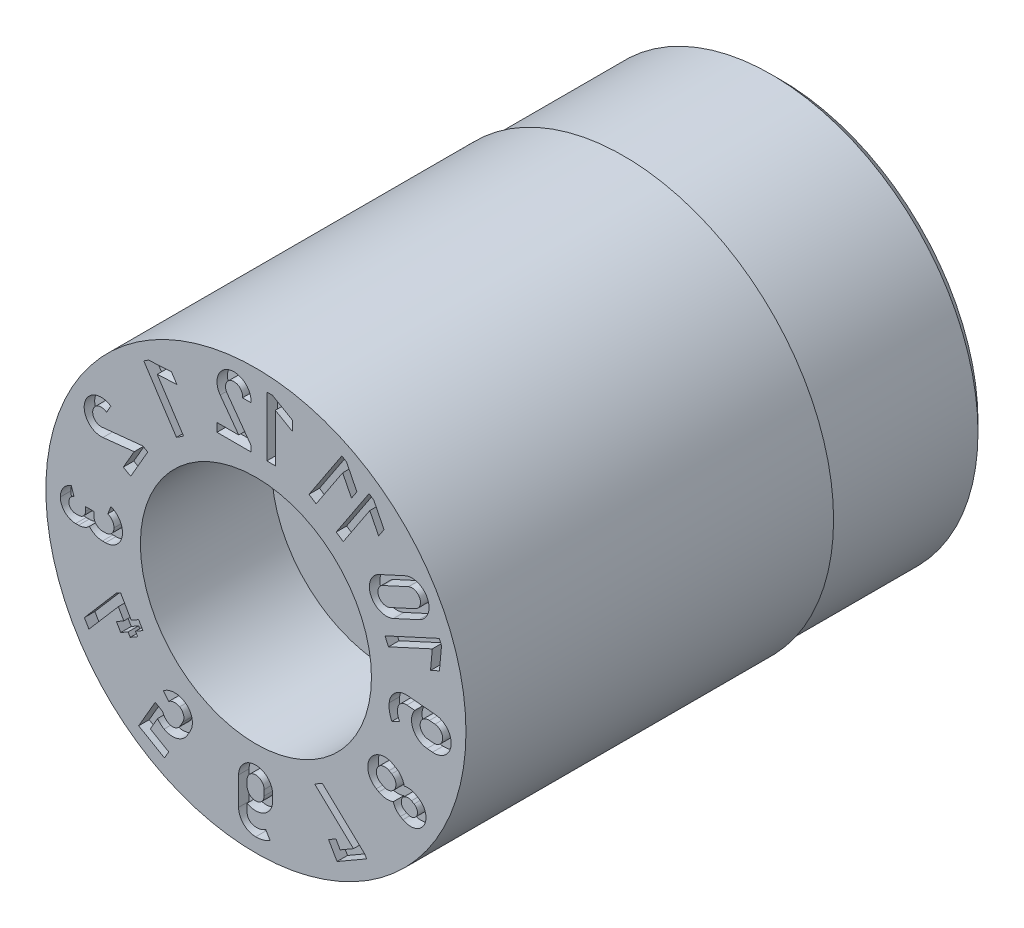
from build123d import *

# Parameters (mm, degrees)
SKETCH4_W          = 3
SKETCH4_H          = 1
CUT_EXTRUDE1_DEPTH = 0.2


with BuildPart() as part:
    # Sketch1 → Revolve1 (revolve)
    with BuildSketch(Plane(origin=(0, 0, 0), x_dir=(0, 0, -1), z_dir=(1, 0, 0)), mode=Mode.PRIVATE) as revolve1_sk:
        Polygon((0, 4), (0, 2.2), (2.5, 2.2), (2.5, 1.15), (10, 1.15), (10, 3.75), (9.75, 4), align=None)
    revolve(revolve1_sk.sketch.rotate(Axis((0, 0, 3.797909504), (0, 0, -1)), 90), axis=Axis((0, 0, 3.797909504), (0, 0, -1)))

    # Sketch4 → Cut-Revolve1 (revolve, cut)
    with BuildSketch(Plane(origin=(0, 0, 0), x_dir=(0, 0, -1), z_dir=(1, 0, 0)), mode=Mode.PRIVATE) as cut_revolve1_sk:
        with Locations((8.5, 4.435)):
            Rectangle(SKETCH4_W, SKETCH4_H)
    revolve(cut_revolve1_sk.sketch.rotate(Axis((0, 0, 0), (0, 0, -1)), 90), axis=Axis((0, 0, 0), (0, 0, -1)), mode=Mode.SUBTRACT)

    # Sketch2 → Cut-Extrude1 (cut)
    # profile 1 of 15: a face of its own
    with BuildSketch(Plane.XY):
        Polygon((2.154227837, 3.006336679), (2.243326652, 2.947448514), (2.439813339, 2.555718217), (2.336640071, 2.399615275), (2.168780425, 2.734144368), (1.663359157, 1.96943323), (1.528024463, 2.05888012), align=None)
    # profile 2 of 15: a face of its own
    with BuildSketch(Plane.XY):
        Polygon((1.637584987, 3.370740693), (1.726683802, 3.311852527), (1.923170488, 2.920122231), (1.81999722, 2.764019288), (1.652137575, 3.098548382), (1.146716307, 2.333837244), (1.011381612, 2.423284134), align=None)
    # profile 3 of 15: a face of its own
    with BuildSketch(Plane.XY):
        with BuildLine():
            Line((3.424170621, -0.00732904), (2.891075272, 0.042324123))
            ThreePointArc((2.891075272, 0.042324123), (2.653812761, -0.030993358), (2.537833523, -0.250578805))
            ThreePointArc((2.537833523, -0.250578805), (2.543908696, -0.394903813), (2.588375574, -0.532342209))
            Line((2.588375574, -0.532342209), (2.734865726, -0.461923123))
            ThreePointArc((2.734865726, -0.461923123), (2.700543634, -0.360446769), (2.701009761, -0.253324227))
            ThreePointArc((2.701009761, -0.253324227), (2.762204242, -0.151969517), (2.8759744, -0.119199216))
            Line((2.8759744, -0.119199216), (3.024249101, -0.13304873))
            ThreePointArc((3.024249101, -0.13304873), (2.993402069, -0.456566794), (3.258839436, -0.644072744))
            Line((3.258839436, -0.644072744), (3.3636544, -0.653488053))
            ThreePointArc((3.3636544, -0.653488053), (3.716992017, -0.360666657), (3.424170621, -0.00732904))
        make_face()
        with BuildLine():
            Line((3.409090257, -0.168940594), (3.304108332, -0.159144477))
            ThreePointArc((3.304108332, -0.159144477), (3.127490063, -0.305619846), (3.27397166, -0.48223295))
            Line((3.27397166, -0.48223295), (3.378930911, -0.492026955))
            ThreePointArc((3.378930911, -0.492026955), (3.555553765, -0.345563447), (3.409090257, -0.168940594))
        make_face(mode=Mode.SUBTRACT)
    # profile 4 of 15: a face of its own
    with BuildSketch(Plane.XY):
        Polygon((1.117983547, -2.300315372), (1.264649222, -2.215637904), (2.068406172, -2.973068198), (2.107337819, -3.040499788), (1.545302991, -3.364990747), (1.383057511, -3.083973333), (1.523585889, -3.002839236), (1.604697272, -3.143328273), (1.857585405, -2.997323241), align=None)
    # profile 5 of 15: a face of its own
    with BuildSketch(Plane.XY):
        with BuildLine():
            Line((2.66646065, -1.258279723), (2.617326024, -1.229859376))
            ThreePointArc((2.617326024, -1.229859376), (2.173838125, -1.348501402), (2.292835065, -1.791894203))
            Line((2.292835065, -1.791894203), (2.341975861, -1.820265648))
            ThreePointArc((2.341975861, -1.820265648), (2.476388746, -1.862554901), (2.616053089, -1.843871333))
            ThreePointArc((2.616053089, -1.843871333), (2.666553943, -1.944977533), (2.751623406, -2.019381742))
            Line((2.751623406, -2.019381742), (2.80081375, -2.047734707))
            ThreePointArc((2.80081375, -2.047734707), (3.199636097, -1.940847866), (3.092749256, -1.542025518))
            Line((3.092749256, -1.542025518), (3.043678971, -1.513485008))
            ThreePointArc((3.043678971, -1.513485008), (2.93676234, -1.476805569), (2.823947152, -1.483825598))
            ThreePointArc((2.823947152, -1.483825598), (2.770286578, -1.353538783), (2.66646065, -1.258279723))
        make_face()
        with BuildLine():
            Line((2.832728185, -1.878889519), (2.881917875, -1.90723673))
            ThreePointArc((2.881917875, -1.90723673), (3.059210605, -1.859731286), (3.011705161, -1.682438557))
            Line((3.011705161, -1.682438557), (2.962560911, -1.654012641))
            ThreePointArc((2.962560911, -1.654012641), (2.785026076, -1.701430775), (2.832728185, -1.878889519))
        make_face(mode=Mode.SUBTRACT)
        with BuildLine():
            Line((2.373919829, -1.651397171), (2.423133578, -1.679810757))
            ThreePointArc((2.423133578, -1.679810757), (2.644727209, -1.620407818), (2.58532427, -1.398814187))
            Line((2.58532427, -1.398814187), (2.536188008, -1.37034044))
            ThreePointArc((2.536188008, -1.37034044), (2.31458465, -1.429768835), (2.373919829, -1.651397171))
        make_face(mode=Mode.SUBTRACT)
    # profile 6 of 15: a face of its own
    with BuildSketch(Plane.XY):
        Polygon((3.489885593, 1.2869079), (3.534461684, 1.189854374), (3.494503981, 0.753433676), (3.324464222, 0.675335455), (3.358532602, 1.048063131), (2.525548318, 0.665478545), (2.457840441, 0.812895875), align=None)
    # profile 7 of 15: a face of its own
    with BuildSketch(Plane.XY):
        with BuildLine():
            Line((2.836269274, 1.993620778), (2.349733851, 1.770158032))
            ThreePointArc((2.349733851, 1.770158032), (2.190245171, 1.339782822), (2.62062926, 1.180318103))
            Line((2.62062926, 1.180318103), (3.107176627, 1.403786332))
            ThreePointArc((3.107176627, 1.403786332), (3.266640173, 1.834157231), (2.836269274, 1.993620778))
        make_face()
        with BuildLine():
            Line((2.55290242, 1.327776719), (3.039449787, 1.551244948))
            ThreePointArc((3.039449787, 1.551244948), (3.119181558, 1.766430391), (2.903996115, 1.846162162))
            Line((2.903996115, 1.846162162), (2.4174383, 1.622689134))
            ThreePointArc((2.4174383, 1.622689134), (2.337708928, 1.407498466), (2.55290242, 1.327776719))
        make_face(mode=Mode.SUBTRACT)
    # profile 8 of 15: a face of its own
    with BuildSketch(Plane.XY):
        Polygon((0.20769199, 3.707921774), (0.314492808, 3.707921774), (0.694405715, 3.48945936), (0.694405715, 3.302342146), (0.369914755, 3.488868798), (0.369914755, 2.57222613), (0.20769199, 2.57222613), align=None)
    # profile 9 of 15: a face of its own
    with BuildSketch(Plane.XY):
        with BuildLine():
            Line((-0.740879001, 2.569738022), (-0.091897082, 2.569738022))
            Line((-0.091897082, 2.569738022), (-0.091897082, 2.677038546))
            Line((-0.091897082, 2.677038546), (-0.548128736, 3.310438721))
            ThreePointArc((-0.548128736, 3.310438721), (-0.454513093, 3.563058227), (-0.255982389, 3.380942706))
            Line((-0.255982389, 3.380942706), (-0.092798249, 3.380938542))
            ThreePointArc((-0.092798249, 3.380938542), (-0.504578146, 3.717567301), (-0.679993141, 3.215460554))
            Line((-0.679993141, 3.215460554), (-0.327122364, 2.732006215))
            Line((-0.327122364, 2.732006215), (-0.740879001, 2.732006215))
            Line((-0.740879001, 2.732006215), (-0.740879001, 2.569738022))
        make_face()
    # profile 10 of 15: a face of its own
    with BuildSketch(Plane.XY):
        Polygon((-2.1351523, 3.050497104), (-2.045791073, 3.108986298), (-1.608274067, 3.134255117), (-1.505799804, 2.977692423), (-1.879455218, 2.956054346), (-1.377458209, 2.189090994), (-1.513191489, 2.100250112), align=None)
    # profile 11 of 15: a face of its own
    with BuildSketch(Plane.XY):
        with BuildLine():
            Line((0.31930136, -2.873399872), (0.319665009, -2.978636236))
            ThreePointArc((0.319665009, -2.978636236), (0.157631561, -3.26034644), (-0.167353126, -3.259690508))
            Line((-0.167353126, -3.259690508), (-0.167366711, -3.408610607))
            ThreePointArc((-0.167366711, -3.408610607), (-0.124167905, -3.518844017), (-0.017566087, -3.570357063))
            ThreePointArc((-0.017566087, -3.570357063), (0.089128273, -3.560870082), (0.18697033, -3.517273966))
            Line((0.18697033, -3.517273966), (0.270714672, -3.656599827))
            ThreePointArc((0.270714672, -3.656599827), (0.138002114, -3.713643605), (-0.005134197, -3.733101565))
            ThreePointArc((-0.005134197, -3.733101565), (-0.234545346, -3.638025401), (-0.329589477, -3.408600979))
            Line((-0.329589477, -3.408600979), (-0.329680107, -2.873178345))
            ThreePointArc((-0.329680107, -2.873178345), (-0.00507861, -2.548798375), (0.31930136, -2.873399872))
        make_face()
        with BuildLine():
            Line((-0.167366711, -2.873198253), (-0.167366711, -2.978636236))
            ThreePointArc((-0.167366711, -2.978636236), (-0.005115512, -3.140881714), (0.157124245, -2.978624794))
            Line((0.157124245, -2.978624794), (0.157124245, -2.873209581))
            ThreePointArc((0.157124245, -2.873209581), (-0.005115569, -2.710958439), (-0.167366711, -2.873198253))
        make_face(mode=Mode.SUBTRACT)
    # profile 12 of 15: a face of its own
    with BuildSketch(Plane.XY):
        with BuildLine():
            Line((-1.872102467, -2.716525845), (-2.010702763, -2.9565886))
            Line((-2.010702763, -2.9565886), (-1.659422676, -3.159400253))
            Line((-1.659422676, -3.159400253), (-1.740560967, -3.299935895))
            Line((-1.740560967, -3.299935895), (-2.232331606, -3.016011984))
            Line((-2.232331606, -3.016011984), (-1.917425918, -2.470579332))
            Line((-1.917425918, -2.470579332), (-1.776936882, -2.551690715))
            ThreePointArc((-1.776936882, -2.551690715), (-1.734593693, -2.629174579), (-1.667409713, -2.686472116))
            ThreePointArc((-1.667409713, -2.686472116), (-1.544302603, -2.702689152), (-1.445817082, -2.627065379))
            Line((-1.445817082, -2.627065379), (-1.393051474, -2.535763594))
            ThreePointArc((-1.393051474, -2.535763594), (-1.376819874, -2.41264151), (-1.452452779, -2.314141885))
            ThreePointArc((-1.452452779, -2.314141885), (-1.55951632, -2.289691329), (-1.661806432, -2.329655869))
            Line((-1.661806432, -2.329655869), (-1.762816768, -2.202515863))
            ThreePointArc((-1.762816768, -2.202515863), (-1.571532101, -2.127724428), (-1.371335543, -2.173603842))
            ThreePointArc((-1.371335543, -2.173603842), (-1.220232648, -2.370665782), (-1.252563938, -2.61687744))
            Line((-1.252563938, -2.61687744), (-1.30538488, -2.708093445))
            ThreePointArc((-1.30538488, -2.708093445), (-1.502410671, -2.859107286), (-1.748560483, -2.826941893))
            ThreePointArc((-1.748560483, -2.826941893), (-1.81607905, -2.778164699), (-1.872102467, -2.716525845))
        make_face()
    # profile 13 of 15: a face of its own
    with BuildSketch(Plane.XY):
        with BuildLine():
            Line((-2.864362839, -0.150379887), (-2.921149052, -0.150379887))
            ThreePointArc((-2.921149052, -0.150379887), (-3.035844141, -0.1028718), (-3.083352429, 0.011823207))
            Line((-3.083352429, 0.011823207), (-3.083352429, 0.092931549))
            Line((-3.083352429, 0.092931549), (-3.245620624, 0.092931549))
            Line((-3.245620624, 0.092931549), (-3.245620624, 0.01184288))
            ThreePointArc((-3.245620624, 0.01184288), (-3.283634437, -0.079930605), (-3.375407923, -0.117944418))
            Line((-3.375407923, -0.117944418), (-3.432186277, -0.117944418))
            ThreePointArc((-3.432186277, -0.117944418), (-3.523927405, -0.079898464), (-3.561979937, 0.011839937))
            ThreePointArc((-3.561979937, 0.011839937), (-3.534633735, 0.096994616), (-3.462719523, 0.150168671))
            Line((-3.462719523, 0.150168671), (-3.514644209, 0.303898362))
            ThreePointArc((-3.514644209, 0.303898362), (-3.666392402, 0.191580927), (-3.724228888, 0.011865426))
            ThreePointArc((-3.724228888, 0.011865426), (-3.638706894, -0.19467697), (-3.432170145, -0.2802126))
            Line((-3.432170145, -0.2802126), (-3.375407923, -0.2802126))
            ThreePointArc((-3.375407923, -0.2802126), (-3.264561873, -0.258348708), (-3.170320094, -0.196032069))
            ThreePointArc((-3.170320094, -0.196032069), (-3.058707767, -0.282067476), (-2.921142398, -0.312648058))
            Line((-2.921142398, -0.312648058), (-2.864335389, -0.312648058))
            ThreePointArc((-2.864335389, -0.312648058), (-2.634908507, -0.217606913), (-2.539899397, 0.011833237))
            ThreePointArc((-2.539899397, 0.011833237), (-2.600351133, 0.208077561), (-2.760713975, 0.336335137))
            Line((-2.760713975, 0.336335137), (-2.820243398, 0.185451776))
            ThreePointArc((-2.820243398, 0.185451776), (-2.734453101, 0.116844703), (-2.702122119, 0.011860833))
            ThreePointArc((-2.702122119, 0.011860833), (-2.749641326, -0.10286068), (-2.864362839, -0.150379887))
        make_face()
    # profile 14 of 15: a face of its own
    with BuildSketch(Plane.XY):
        Polygon((-3.265969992, -1.747669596), (-3.18004326, -1.896499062), (-2.619481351, -1.2450114), (-2.514384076, -1.42704522), (-2.654873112, -1.508156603), (-2.573761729, -1.648645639), (-2.433272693, -1.567534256), (-2.392705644, -1.637798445), (-2.252216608, -1.556687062), (-2.292783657, -1.486422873), (-2.152255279, -1.405288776), (-2.233366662, -1.26479974), (-2.373895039, -1.345933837), (-2.576707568, -0.994652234), (-2.658852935, -1.042078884), align=None)
    # profile 15 of 15: a face of its own
    with BuildSketch(Plane.XY):
        with BuildLine():
            Line((-2.524672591, 1.103815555), (-2.384144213, 1.022681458))
            Line((-2.384144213, 1.022681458), (-2.059652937, 1.584716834))
            Line((-2.059652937, 1.584716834), (-2.152575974, 1.638365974))
            Line((-2.152575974, 1.638365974), (-2.929232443, 1.559957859))
            ThreePointArc((-2.929232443, 1.559957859), (-3.101191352, 1.767331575), (-2.84422116, 1.848202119))
            Line((-2.84422116, 1.848202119), (-2.762629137, 1.989531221))
            ThreePointArc((-2.762629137, 1.989531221), (-3.260039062, 1.801232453), (-2.912913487, 1.398272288))
            Line((-2.912913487, 1.398272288), (-2.317794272, 1.462139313))
            Line((-2.317794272, 1.462139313), (-2.524672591, 1.103815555))
        make_face()
    extrude(amount=-CUT_EXTRUDE1_DEPTH, mode=Mode.SUBTRACT)


solid = part.part
